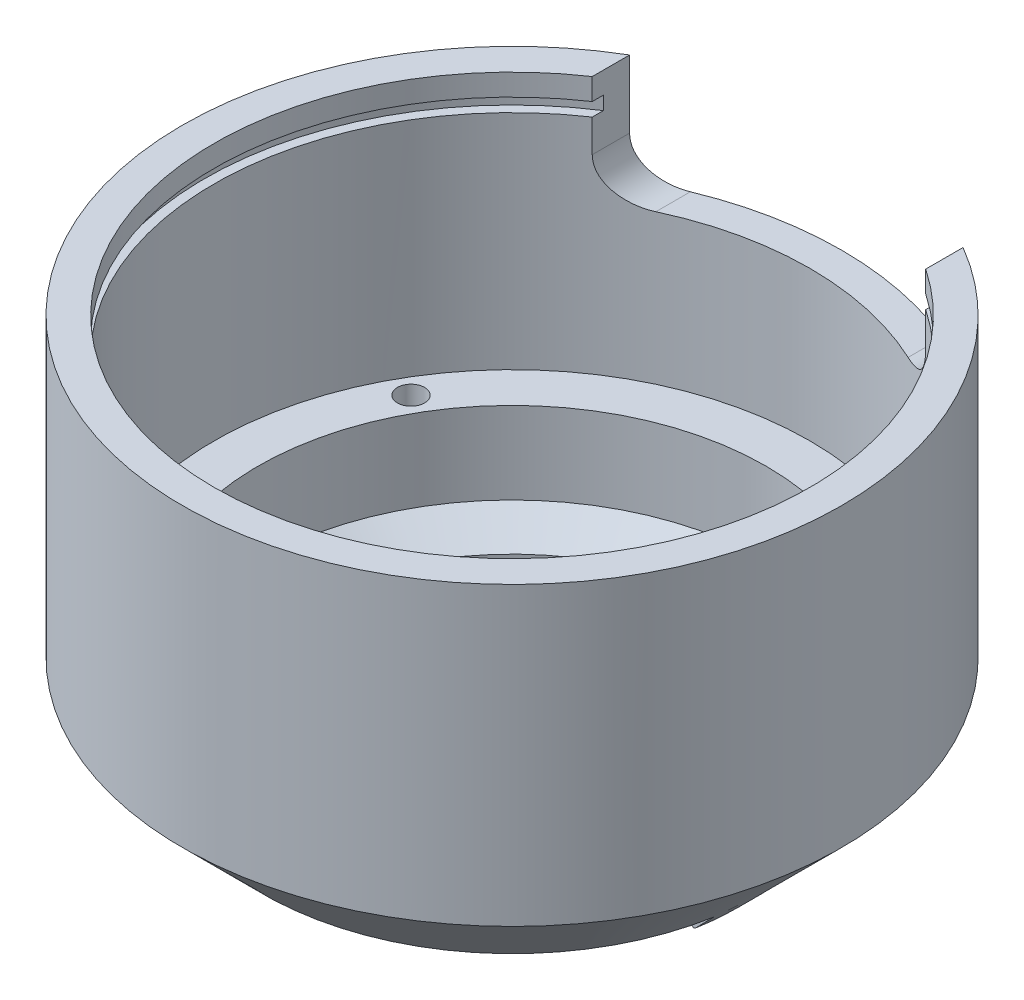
ISO-10303-21;
HEADER;
FILE_DESCRIPTION(('STEP AP214'),'2;1');
FILE_NAME('part.step','',(''),(''),'','','');
FILE_SCHEMA(('AUTOMOTIVE_DESIGN { 1 0 10303 214 1 1 1 1 }'));
ENDSEC;
DATA;
#1=APPLICATION_CONTEXT('core data for automotive mechanical design processes');
#2=APPLICATION_PROTOCOL_DEFINITION('international standard','automotive_design',2000,#1);
#3=PRODUCT_CONTEXT('',#1,'mechanical');
#4=PRODUCT('Part','Part','',(#3));
#5=PRODUCT_RELATED_PRODUCT_CATEGORY('part','',(#4));
#6=PRODUCT_DEFINITION_FORMATION('','',#4);
#7=PRODUCT_DEFINITION_CONTEXT('part definition',#1,'design');
#8=PRODUCT_DEFINITION('design','',#6,#7);
#9=PRODUCT_DEFINITION_SHAPE('','',#8);
#10=(LENGTH_UNIT() NAMED_UNIT(*) SI_UNIT(.MILLI.,.METRE.));
#11=(NAMED_UNIT(*) PLANE_ANGLE_UNIT() SI_UNIT($,.RADIAN.));
#12=(NAMED_UNIT(*) SI_UNIT($,.STERADIAN.) SOLID_ANGLE_UNIT());
#13=UNCERTAINTY_MEASURE_WITH_UNIT(LENGTH_MEASURE(1.E-05),#10,'distance_accuracy_value','');
#14=(GEOMETRIC_REPRESENTATION_CONTEXT(3) GLOBAL_UNCERTAINTY_ASSIGNED_CONTEXT((#13)) GLOBAL_UNIT_ASSIGNED_CONTEXT((#10,
#11,#12)) REPRESENTATION_CONTEXT('',''));
#15=CARTESIAN_POINT('',(0.,0.,0.));
#16=DIRECTION('',(0.,0.,1.));
#17=DIRECTION('',(1.,0.,0.));
#18=AXIS2_PLACEMENT_3D('',#15,#16,#17);
#19=CARTESIAN_POINT('',(0.,0.,0.));
#20=DIRECTION('',(0.,-1.,0.));
#21=DIRECTION('',(0.,0.,-1.));
#22=AXIS2_PLACEMENT_3D('',#19,#20,#21);
#23=CYLINDRICAL_SURFACE('',#22,12.954);
#24=CARTESIAN_POINT('',(0.,2.2098,0.));
#25=DIRECTION('',(0.,-1.,0.));
#26=DIRECTION('',(0.,0.,-1.));
#27=AXIS2_PLACEMENT_3D('',#24,#25,#26);
#28=CIRCLE('',#27,12.954);
#29=CARTESIAN_POINT('',(0.,2.2098,-12.954));
#30=VERTEX_POINT('',#29);
#31=EDGE_CURVE('E220',#30,#30,#28,.T.);
#32=ORIENTED_EDGE('',*,*,#31,.F.);
#33=EDGE_LOOP('',(#32));
#34=FACE_BOUND('',#33,.T.);
#35=DIRECTION('',(0.,-1.,0.));
#36=VECTOR('',#35,1.);
#37=CARTESIAN_POINT('',(-8.32667069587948,0.,9.9233397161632));
#38=LINE('',#37,#36);
#39=CARTESIAN_POINT('',(-8.32667069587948,1.397,9.9233397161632));
#40=VERTEX_POINT('',#39);
#41=CARTESIAN_POINT('',(-8.32667069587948,0.1778,9.9233397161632));
#42=VERTEX_POINT('',#41);
#43=EDGE_CURVE('E485',#40,#42,#38,.T.);
#44=ORIENTED_EDGE('',*,*,#43,.F.);
#45=CARTESIAN_POINT('',(0.,1.397,0.));
#46=DIRECTION('',(0.,1.,0.));
#47=DIRECTION('',(0.,0.,1.));
#48=AXIS2_PLACEMENT_3D('',#45,#46,#47);
#49=CIRCLE('',#48,12.954);
#50=CARTESIAN_POINT('',(-6.4769999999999,1.397,-11.2184930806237));
#51=VERTEX_POINT('',#50);
#52=EDGE_CURVE('E474',#40,#51,#49,.F.);
#53=ORIENTED_EDGE('',*,*,#52,.T.);
#54=DIRECTION('',(0.,-1.,0.));
#55=VECTOR('',#54,1.);
#56=CARTESIAN_POINT('',(-6.4769999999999,0.,-11.2184930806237));
#57=LINE('',#56,#55);
#58=CARTESIAN_POINT('',(-6.4769999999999,0.1778,-11.2184930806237));
#59=VERTEX_POINT('',#58);
#60=EDGE_CURVE('E481',#59,#51,#57,.F.);
#61=ORIENTED_EDGE('',*,*,#60,.F.);
#62=CARTESIAN_POINT('',(0.,0.1778,0.));
#63=DIRECTION('',(0.,-1.,0.));
#64=DIRECTION('',(0.,0.,-1.));
#65=AXIS2_PLACEMENT_3D('',#62,#63,#64);
#66=CIRCLE('',#65,12.954);
#67=CARTESIAN_POINT('',(-4.43052893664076,0.1778,-12.1727782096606));
#68=VERTEX_POINT('',#67);
#69=EDGE_CURVE('E215',#59,#68,#66,.T.);
#70=ORIENTED_EDGE('',*,*,#69,.T.);
#71=DIRECTION('',(0.,-1.,0.));
#72=VECTOR('',#71,1.);
#73=CARTESIAN_POINT('',(-4.43052893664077,0.,-12.1727782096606));
#74=LINE('',#73,#72);
#75=CARTESIAN_POINT('',(-4.43052893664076,1.397,-12.1727782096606));
#76=VERTEX_POINT('',#75);
#77=EDGE_CURVE('E423',#76,#68,#74,.T.);
#78=ORIENTED_EDGE('',*,*,#77,.F.);
#79=CARTESIAN_POINT('',(0.,1.397,0.));
#80=DIRECTION('',(0.,1.,0.));
#81=DIRECTION('',(0.,0.,1.));
#82=AXIS2_PLACEMENT_3D('',#79,#80,#81);
#83=CIRCLE('',#82,12.954);
#84=CARTESIAN_POINT('',(12.954,1.397,0.));
#85=VERTEX_POINT('',#84);
#86=EDGE_CURVE('E510',#76,#85,#83,.F.);
#87=ORIENTED_EDGE('',*,*,#86,.T.);
#88=DIRECTION('',(0.,-1.,0.));
#89=VECTOR('',#88,1.);
#90=CARTESIAN_POINT('',(12.954,0.,0.));
#91=LINE('',#90,#89);
#92=CARTESIAN_POINT('',(12.954,0.1778,0.));
#93=VERTEX_POINT('',#92);
#94=EDGE_CURVE('E515',#93,#85,#91,.F.);
#95=ORIENTED_EDGE('',*,*,#94,.F.);
#96=CARTESIAN_POINT('',(12.7571996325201,0.1778,2.24943849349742));
#97=VERTEX_POINT('',#96);
#98=EDGE_CURVE('E217',#93,#97,#66,.T.);
#99=ORIENTED_EDGE('',*,*,#98,.T.);
#100=DIRECTION('',(0.,-1.,0.));
#101=VECTOR('',#100,1.);
#102=CARTESIAN_POINT('',(12.7571996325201,0.,2.24943849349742));
#103=LINE('',#102,#101);
#104=CARTESIAN_POINT('',(12.7571996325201,1.397,2.24943849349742));
#105=VERTEX_POINT('',#104);
#106=EDGE_CURVE('E502',#105,#97,#103,.T.);
#107=ORIENTED_EDGE('',*,*,#106,.F.);
#108=CARTESIAN_POINT('',(0.,1.397,0.));
#109=DIRECTION('',(0.,1.,0.));
#110=DIRECTION('',(0.,0.,1.));
#111=AXIS2_PLACEMENT_3D('',#108,#109,#110);
#112=CIRCLE('',#111,12.954);
#113=CARTESIAN_POINT('',(-6.47700000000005,1.397,11.2184930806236));
#114=VERTEX_POINT('',#113);
#115=EDGE_CURVE('E493',#105,#114,#112,.F.);
#116=ORIENTED_EDGE('',*,*,#115,.T.);
#117=DIRECTION('',(0.,-1.,0.));
#118=VECTOR('',#117,1.);
#119=CARTESIAN_POINT('',(-6.47700000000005,0.,11.2184930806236));
#120=LINE('',#119,#118);
#121=CARTESIAN_POINT('',(-6.47700000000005,0.1778,11.2184930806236));
#122=VERTEX_POINT('',#121);
#123=EDGE_CURVE('E498',#122,#114,#120,.F.);
#124=ORIENTED_EDGE('',*,*,#123,.F.);
#125=EDGE_CURVE('E221',#122,#42,#66,.T.);
#126=ORIENTED_EDGE('',*,*,#125,.T.);
#127=EDGE_LOOP('',(#44,#53,#61,#70,#78,#87,#95,#99,#107,#116,#124,#126));
#128=FACE_BOUND('',#127,.T.);
#129=ADVANCED_FACE('F30',(#34,#128),#23,.F.);
#130=CARTESIAN_POINT('',(0.,0.1778,0.));
#131=DIRECTION('',(0.,-1.,0.));
#132=DIRECTION('',(0.,0.,-1.));
#133=AXIS2_PLACEMENT_3D('',#130,#131,#132);
#134=TOROIDAL_SURFACE('',#133,13.1318,0.1778);
#135=CARTESIAN_POINT('',(0.,0.0520764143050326,0.));
#136=DIRECTION('',(0.,-1.,0.));
#137=DIRECTION('',(0.,0.,-1.));
#138=AXIS2_PLACEMENT_3D('',#135,#136,#137);
#139=CIRCLE('',#138,13.257523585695);
#140=CARTESIAN_POINT('',(-6.62876179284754,0.0520764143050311,11.4813522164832));
#141=VERTEX_POINT('',#140);
#142=CARTESIAN_POINT('',(-8.52177189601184,0.0520764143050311,10.1558522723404));
#143=VERTEX_POINT('',#142);
#144=EDGE_CURVE('E216',#141,#143,#139,.T.);
#145=ORIENTED_EDGE('',*,*,#144,.T.);
#146=CARTESIAN_POINT('',(-8.44095833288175,0.1778,10.0595424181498));
#147=DIRECTION('',(-0.766044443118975,0.,-0.642787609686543));
#148=DIRECTION('',(-0.642787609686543,0.,0.766044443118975));
#149=AXIS2_PLACEMENT_3D('',#146,#147,#148);
#150=CIRCLE('',#149,0.1778);
#151=EDGE_CURVE('E483',#42,#143,#150,.T.);
#152=ORIENTED_EDGE('',*,*,#151,.F.);
#153=ORIENTED_EDGE('',*,*,#125,.F.);
#154=CARTESIAN_POINT('',(-6.56590000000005,0.1778,11.3724723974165));
#155=DIRECTION('',(0.866025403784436,0.,0.500000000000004));
#156=DIRECTION('',(0.500000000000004,0.,-0.866025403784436));
#157=AXIS2_PLACEMENT_3D('',#154,#155,#156);
#158=CIRCLE('',#157,0.1778);
#159=EDGE_CURVE('E496',#141,#122,#158,.T.);
#160=ORIENTED_EDGE('',*,*,#159,.F.);
#161=EDGE_LOOP('',(#145,#152,#153,#160));
#162=FACE_BOUND('',#161,.T.);
#163=ADVANCED_FACE('F372',(#162),#134,.T.);
#164=CARTESIAN_POINT('',(-6.5658999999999,0.1778,-11.3724723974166));
#165=DIRECTION('',(-0.866025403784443,0.,0.499999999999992));
#166=DIRECTION('',(0.499999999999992,0.,0.866025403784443));
#167=AXIS2_PLACEMENT_3D('',#164,#165,#166);
#168=CIRCLE('',#167,0.1778);
#169=CARTESIAN_POINT('',(-6.62876179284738,0.0520764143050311,-11.4813522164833));
#170=VERTEX_POINT('',#169);
#171=EDGE_CURVE('E479',#170,#59,#168,.T.);
#172=ORIENTED_EDGE('',*,*,#171,.F.);
#173=CARTESIAN_POINT('',(-4.53434011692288,0.0520764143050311,-12.4579970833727));
#174=VERTEX_POINT('',#173);
#175=EDGE_CURVE('E206',#170,#174,#139,.T.);
#176=ORIENTED_EDGE('',*,*,#175,.T.);
#177=CARTESIAN_POINT('',(-4.49134011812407,0.1778,-12.3398555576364));
#178=DIRECTION('',(0.939692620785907,0.,-0.342020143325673));
#179=DIRECTION('',(-0.342020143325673,0.,-0.939692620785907));
#180=AXIS2_PLACEMENT_3D('',#177,#178,#179);
#181=CIRCLE('',#180,0.1778);
#182=EDGE_CURVE('E428',#68,#174,#181,.T.);
#183=ORIENTED_EDGE('',*,*,#182,.F.);
#184=ORIENTED_EDGE('',*,*,#69,.F.);
#185=EDGE_LOOP('',(#172,#176,#183,#184));
#186=FACE_BOUND('',#185,.T.);
#187=ADVANCED_FACE('F378',(#186),#134,.T.);
#188=CARTESIAN_POINT('',(0.,6.12395282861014,0.));
#189=DIRECTION('',(0.,1.,0.));
#190=DIRECTION('',(0.,0.,1.));
#191=AXIS2_PLACEMENT_3D('',#188,#189,#190);
#192=CONICAL_SURFACE('',#191,19.3294,0.785398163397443);
#193=CARTESIAN_POINT('',(0.,6.12395282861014,0.));
#194=DIRECTION('',(0.,-1.,0.));
#195=DIRECTION('',(0.,0.,-1.));
#196=AXIS2_PLACEMENT_3D('',#193,#194,#195);
#197=CIRCLE('',#196,19.3294);
#198=CARTESIAN_POINT('',(0.,6.12395282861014,-19.3294));
#199=VERTEX_POINT('',#198);
#200=EDGE_CURVE('E202',#199,#199,#197,.T.);
#201=ORIENTED_EDGE('',*,*,#200,.T.);
#202=EDGE_LOOP('',(#201));
#203=FACE_BOUND('',#202,.T.);
#204=DIRECTION('',(-0.454519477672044,0.707106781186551,0.541675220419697));
#205=VECTOR('',#204,1.);
#206=CARTESIAN_POINT('',(0.,-13.2054471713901,0.));
#207=LINE('',#206,#205);
#208=CARTESIAN_POINT('',(-9.38627211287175,1.397,11.1861235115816));
#209=VERTEX_POINT('',#208);
#210=EDGE_CURVE('E254',#143,#209,#207,.T.);
#211=ORIENTED_EDGE('',*,*,#210,.F.);
#212=ORIENTED_EDGE('',*,*,#144,.F.);
#213=DIRECTION('',(0.353553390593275,-0.707106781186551,-0.61237243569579));
#214=VECTOR('',#213,1.);
#215=CARTESIAN_POINT('',(0.,-13.2054471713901,0.));
#216=LINE('',#215,#214);
#217=CARTESIAN_POINT('',(-7.30122358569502,1.397,12.6460902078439));
#218=VERTEX_POINT('',#217);
#219=EDGE_CURVE('E242',#218,#141,#216,.T.);
#220=ORIENTED_EDGE('',*,*,#219,.F.);
#221=CARTESIAN_POINT('',(0.,1.397,0.));
#222=DIRECTION('',(0.,1.,0.));
#223=DIRECTION('',(0.,0.,1.));
#224=AXIS2_PLACEMENT_3D('',#221,#222,#223);
#225=CIRCLE('',#224,14.6024471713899);
#226=CARTESIAN_POINT('',(14.380603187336,1.397,2.53568834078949));
#227=VERTEX_POINT('',#226);
#228=EDGE_CURVE('E239',#218,#227,#225,.T.);
#229=ORIENTED_EDGE('',*,*,#228,.T.);
#230=DIRECTION('',(0.696364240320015,0.707106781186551,0.122787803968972));
#231=VECTOR('',#230,1.);
#232=CARTESIAN_POINT('',(0.,-13.2054471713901,0.));
#233=LINE('',#232,#231);
#234=CARTESIAN_POINT('',(13.0561120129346,0.0520764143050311,2.30214481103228));
#235=VERTEX_POINT('',#234);
#236=EDGE_CURVE('E245',#235,#227,#233,.T.);
#237=ORIENTED_EDGE('',*,*,#236,.F.);
#238=CARTESIAN_POINT('',(13.257523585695,0.0520764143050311,0.));
#239=VERTEX_POINT('',#238);
#240=EDGE_CURVE('E212',#239,#235,#139,.T.);
#241=ORIENTED_EDGE('',*,*,#240,.F.);
#242=DIRECTION('',(-0.707106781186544,-0.707106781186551,0.));
#243=VECTOR('',#242,1.);
#244=CARTESIAN_POINT('',(0.,-13.2054471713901,0.));
#245=LINE('',#244,#243);
#246=CARTESIAN_POINT('',(14.6024471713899,1.397,0.));
#247=VERTEX_POINT('',#246);
#248=EDGE_CURVE('E233',#247,#239,#245,.T.);
#249=ORIENTED_EDGE('',*,*,#248,.F.);
#250=CARTESIAN_POINT('',(0.,1.397,0.));
#251=DIRECTION('',(0.,1.,0.));
#252=DIRECTION('',(0.,0.,1.));
#253=AXIS2_PLACEMENT_3D('',#250,#251,#252);
#254=CIRCLE('',#253,14.6024471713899);
#255=CARTESIAN_POINT('',(-4.99433107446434,1.397,-13.7218118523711));
#256=VERTEX_POINT('',#255);
#257=EDGE_CURVE('E230',#247,#256,#254,.T.);
#258=ORIENTED_EDGE('',*,*,#257,.T.);
#259=DIRECTION('',(-0.241844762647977,0.707106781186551,-0.66446302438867));
#260=VECTOR('',#259,1.);
#261=CARTESIAN_POINT('',(0.,-13.2054471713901,0.));
#262=LINE('',#261,#260);
#263=EDGE_CURVE('E236',#174,#256,#262,.T.);
#264=ORIENTED_EDGE('',*,*,#263,.F.);
#265=ORIENTED_EDGE('',*,*,#175,.F.);
#266=DIRECTION('',(0.353553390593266,-0.707106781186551,0.612372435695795));
#267=VECTOR('',#266,1.);
#268=CARTESIAN_POINT('',(0.,-13.2054471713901,0.));
#269=LINE('',#268,#267);
#270=CARTESIAN_POINT('',(-7.30122358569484,1.397,-12.646090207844));
#271=VERTEX_POINT('',#270);
#272=EDGE_CURVE('E251',#271,#170,#269,.T.);
#273=ORIENTED_EDGE('',*,*,#272,.F.);
#274=CARTESIAN_POINT('',(0.,1.397,0.));
#275=DIRECTION('',(0.,1.,0.));
#276=DIRECTION('',(0.,0.,1.));
#277=AXIS2_PLACEMENT_3D('',#274,#275,#276);
#278=CIRCLE('',#277,14.6024471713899);
#279=EDGE_CURVE('E248',#271,#209,#278,.T.);
#280=ORIENTED_EDGE('',*,*,#279,.T.);
#281=EDGE_LOOP('',(#211,#212,#220,#229,#237,#241,#249,#258,#264,#265,#273,#280));
#282=FACE_BOUND('',#281,.T.);
#283=ADVANCED_FACE('F404',(#203,#282),#192,.T.);
#284=ORIENTED_EDGE('',*,*,#240,.T.);
#285=CARTESIAN_POINT('',(12.9322984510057,0.1778,2.2803131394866));
#286=DIRECTION('',(-0.173648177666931,0.,0.984807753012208));
#287=DIRECTION('',(0.984807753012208,0.,0.173648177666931));
#288=AXIS2_PLACEMENT_3D('',#285,#286,#287);
#289=CIRCLE('',#288,0.1778);
#290=EDGE_CURVE('E500',#97,#235,#289,.T.);
#291=ORIENTED_EDGE('',*,*,#290,.F.);
#292=ORIENTED_EDGE('',*,*,#98,.F.);
#293=CARTESIAN_POINT('',(13.1318,0.1778,0.));
#294=DIRECTION('',(0.,0.,-1.));
#295=DIRECTION('',(-1.,0.,0.));
#296=AXIS2_PLACEMENT_3D('',#293,#294,#295);
#297=CIRCLE('',#296,0.1778);
#298=EDGE_CURVE('E513',#239,#93,#297,.T.);
#299=ORIENTED_EDGE('',*,*,#298,.F.);
#300=EDGE_LOOP('',(#284,#291,#292,#299));
#301=FACE_BOUND('',#300,.T.);
#302=ADVANCED_FACE('F381',(#301),#134,.T.);
#303=CARTESIAN_POINT('',(-14.90726,8.382,0.));
#304=DIRECTION('',(0.,-1.,0.));
#305=DIRECTION('',(0.,0.,-1.));
#306=AXIS2_PLACEMENT_3D('',#303,#304,#305);
#307=PLANE('',#306);
#308=CARTESIAN_POINT('',(14.0220164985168,8.382,-8.09561499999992));
#309=DIRECTION('',(0.,1.,0.));
#310=DIRECTION('',(0.,0.,1.));
#311=AXIS2_PLACEMENT_3D('',#308,#309,#310);
#312=CIRCLE('',#311,0.793749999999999);
#313=CARTESIAN_POINT('',(14.0220164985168,8.382,-7.30186499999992));
#314=VERTEX_POINT('',#313);
#315=EDGE_CURVE('E409',#314,#314,#312,.T.);
#316=ORIENTED_EDGE('',*,*,#315,.F.);
#317=EDGE_LOOP('',(#316));
#318=FACE_BOUND('',#317,.T.);
#319=CARTESIAN_POINT('',(-14.0220164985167,8.382,-8.09561500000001));
#320=DIRECTION('',(0.,1.,0.));
#321=DIRECTION('',(0.,0.,1.));
#322=AXIS2_PLACEMENT_3D('',#319,#320,#321);
#323=CIRCLE('',#322,0.793749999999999);
#324=CARTESIAN_POINT('',(-14.0220164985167,8.382,-7.30186500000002));
#325=VERTEX_POINT('',#324);
#326=EDGE_CURVE('E413',#325,#325,#323,.T.);
#327=ORIENTED_EDGE('',*,*,#326,.F.);
#328=EDGE_LOOP('',(#327));
#329=FACE_BOUND('',#328,.T.);
#330=CARTESIAN_POINT('',(0.,8.382,16.19123));
#331=DIRECTION('',(0.,1.,0.));
#332=DIRECTION('',(0.,0.,1.));
#333=AXIS2_PLACEMENT_3D('',#330,#331,#332);
#334=CIRCLE('',#333,0.793749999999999);
#335=CARTESIAN_POINT('',(0.,8.382,16.98498));
#336=VERTEX_POINT('',#335);
#337=EDGE_CURVE('E417',#336,#336,#334,.T.);
#338=ORIENTED_EDGE('',*,*,#337,.F.);
#339=EDGE_LOOP('',(#338));
#340=FACE_BOUND('',#339,.T.);
#341=CARTESIAN_POINT('',(0.,8.382,0.));
#342=DIRECTION('',(0.,-1.,0.));
#343=DIRECTION('',(0.,0.,-1.));
#344=AXIS2_PLACEMENT_3D('',#341,#342,#343);
#345=CIRCLE('',#344,17.4752);
#346=CARTESIAN_POINT('',(0.,8.382,-17.4752));
#347=VERTEX_POINT('',#346);
#348=EDGE_CURVE('E420',#347,#347,#345,.T.);
#349=ORIENTED_EDGE('',*,*,#348,.F.);
#350=EDGE_LOOP('',(#349));
#351=FACE_BOUND('',#350,.T.);
#352=CARTESIAN_POINT('',(0.,8.382,0.));
#353=DIRECTION('',(0.,-1.,0.));
#354=DIRECTION('',(0.,0.,-1.));
#355=AXIS2_PLACEMENT_3D('',#352,#353,#354);
#356=CIRCLE('',#355,14.90726);
#357=CARTESIAN_POINT('',(0.,8.382,-14.90726));
#358=VERTEX_POINT('',#357);
#359=EDGE_CURVE('E227',#358,#358,#356,.T.);
#360=ORIENTED_EDGE('',*,*,#359,.T.);
#361=EDGE_LOOP('',(#360));
#362=FACE_BOUND('',#361,.T.);
#363=ADVANCED_FACE('F32',(#318,#329,#340,#351,#362),#307,.F.);
#364=CARTESIAN_POINT('',(0.,0.,0.));
#365=DIRECTION('',(0.,-1.,0.));
#366=DIRECTION('',(0.,0.,-1.));
#367=AXIS2_PLACEMENT_3D('',#364,#365,#366);
#368=CYLINDRICAL_SURFACE('',#367,14.90726);
#369=ORIENTED_EDGE('',*,*,#359,.F.);
#370=EDGE_LOOP('',(#369));
#371=FACE_BOUND('',#370,.T.);
#372=CARTESIAN_POINT('',(0.,3.57748737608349,0.));
#373=DIRECTION('',(0.,-1.,0.));
#374=DIRECTION('',(0.,0.,-1.));
#375=AXIS2_PLACEMENT_3D('',#372,#373,#374);
#376=CIRCLE('',#375,14.90726);
#377=CARTESIAN_POINT('',(0.,3.57748737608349,-14.90726));
#378=VERTEX_POINT('',#377);
#379=EDGE_CURVE('E224',#378,#378,#376,.T.);
#380=ORIENTED_EDGE('',*,*,#379,.T.);
#381=EDGE_LOOP('',(#380));
#382=FACE_BOUND('',#381,.T.);
#383=ADVANCED_FACE('F388',(#371,#382),#368,.F.);
#384=CARTESIAN_POINT('',(0.,2.2098,0.));
#385=DIRECTION('',(0.,1.,0.));
#386=DIRECTION('',(0.,0.,1.));
#387=AXIS2_PLACEMENT_3D('',#384,#385,#386);
#388=CONICAL_SURFACE('',#387,12.954,0.959931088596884);
#389=ORIENTED_EDGE('',*,*,#379,.F.);
#390=EDGE_LOOP('',(#389));
#391=FACE_BOUND('',#390,.T.);
#392=ORIENTED_EDGE('',*,*,#31,.T.);
#393=EDGE_LOOP('',(#392));
#394=FACE_BOUND('',#393,.T.);
#395=ADVANCED_FACE('F386',(#391,#394),#388,.F.);
#396=CARTESIAN_POINT('',(0.,0.,0.));
#397=DIRECTION('',(0.,-1.,0.));
#398=DIRECTION('',(0.,0.,-1.));
#399=AXIS2_PLACEMENT_3D('',#396,#397,#398);
#400=CYLINDRICAL_SURFACE('',#399,19.3294);
#401=ORIENTED_EDGE('',*,*,#200,.F.);
#402=EDGE_LOOP('',(#401));
#403=FACE_BOUND('',#402,.T.);
#404=DIRECTION('',(0.,-1.,0.));
#405=VECTOR('',#404,1.);
#406=CARTESIAN_POINT('',(-9.77899999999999,0.,-16.6732379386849));
#407=LINE('',#406,#405);
#408=CARTESIAN_POINT('',(-9.779,23.495,-16.6732379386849));
#409=VERTEX_POINT('',#408);
#410=CARTESIAN_POINT('',(-9.77899999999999,19.52625,-16.6732379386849));
#411=VERTEX_POINT('',#410);
#412=EDGE_CURVE('E452',#409,#411,#407,.T.);
#413=ORIENTED_EDGE('',*,*,#412,.T.);
#414=CARTESIAN_POINT('',(-9.779,19.52625,-16.6732379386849));
#415=CARTESIAN_POINT('',(-9.77901067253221,19.4653539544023,-16.6732289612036));
#416=CARTESIAN_POINT('',(-9.77666434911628,19.4044649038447,-16.6746077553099));
#417=CARTESIAN_POINT('',(-9.7673400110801,19.2831890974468,-16.6800727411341));
#418=CARTESIAN_POINT('',(-9.76036389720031,19.222802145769,-16.6841578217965));
#419=CARTESIAN_POINT('',(-9.74190651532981,19.1032554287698,-16.694941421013));
#420=CARTESIAN_POINT('',(-9.73044701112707,19.044091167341,-16.7016273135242));
#421=CARTESIAN_POINT('',(-9.70318131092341,18.9271262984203,-16.7174826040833));
#422=CARTESIAN_POINT('',(-9.68737484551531,18.8693257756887,-16.726652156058));
#423=CARTESIAN_POINT('',(-9.63374745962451,18.6987039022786,-16.7576350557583));
#424=CARTESIAN_POINT('',(-9.5896774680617,18.5884021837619,-16.7829470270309));
#425=CARTESIAN_POINT('',(-9.48672995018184,18.3771771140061,-16.8413521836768));
#426=CARTESIAN_POINT('',(-9.42783692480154,18.2762637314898,-16.8744535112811));
#427=CARTESIAN_POINT('',(-9.29317943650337,18.0796128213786,-16.9490055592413));
#428=CARTESIAN_POINT('',(-9.21659362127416,17.984587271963,-16.9908474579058));
#429=CARTESIAN_POINT('',(-9.05128399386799,17.8084649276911,-17.0794836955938));
#430=CARTESIAN_POINT('',(-8.96255569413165,17.7273733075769,-17.1262798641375));
#431=CARTESIAN_POINT('',(-8.76306456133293,17.5706584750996,-17.2292928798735));
#432=CARTESIAN_POINT('',(-8.6509349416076,17.4970602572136,-17.2859492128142));
#433=CARTESIAN_POINT('',(-8.41674530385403,17.3699166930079,-17.4011825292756));
#434=CARTESIAN_POINT('',(-8.29468200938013,17.3163779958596,-17.4597601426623));
#435=CARTESIAN_POINT('',(-8.04552246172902,17.2310914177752,-17.5759436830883));
#436=CARTESIAN_POINT('',(-7.91855226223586,17.1989773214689,-17.6335486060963));
#437=CARTESIAN_POINT('',(-7.72506584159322,17.166694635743,-17.7187488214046));
#438=CARTESIAN_POINT('',(-7.66005526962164,17.1585817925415,-17.7469518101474));
#439=CARTESIAN_POINT('',(-7.52934056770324,17.1477352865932,-17.8028030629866));
#440=CARTESIAN_POINT('',(-7.46363634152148,17.145002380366,-17.8304512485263));
#441=CARTESIAN_POINT('',(-7.39775,17.145,-17.8577433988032));
#442=B_SPLINE_CURVE_WITH_KNOTS('',3,(#414,#415,#416,#417,#418,#419,#420,#421,#422,#423,#424,
#425,#426,#427,#428,#429,#430,#431,#432,#433,#434,#435,#436,#437,#438,#439,#440,#441),
.UNSPECIFIED.,.F.,.F.,(4,2,2,2,2,2,2,2,2,2,2,2,2,4),(0.,0.182615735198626,0.365156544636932,
0.546822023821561,0.728498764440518,1.09106911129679,1.45402015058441,1.8395390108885,
2.2252007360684,2.66017469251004,3.09529270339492,3.52276834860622,3.73656988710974,
3.95040148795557),.UNSPECIFIED.);
#443=CARTESIAN_POINT('',(-7.39775,17.145,-17.8577433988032));
#444=VERTEX_POINT('',#443);
#445=EDGE_CURVE('E281',#411,#444,#442,.T.);
#446=ORIENTED_EDGE('',*,*,#445,.T.);
#447=CARTESIAN_POINT('',(0.,17.145,0.));
#448=DIRECTION('',(0.,-1.,0.));
#449=DIRECTION('',(0.,0.,-1.));
#450=AXIS2_PLACEMENT_3D('',#447,#448,#449);
#451=CIRCLE('',#450,19.3294);
#452=CARTESIAN_POINT('',(7.39775,17.145,-17.8577433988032));
#453=VERTEX_POINT('',#452);
#454=EDGE_CURVE('E585',#444,#453,#451,.T.);
#455=ORIENTED_EDGE('',*,*,#454,.T.);
#456=CARTESIAN_POINT('',(7.39775,17.145,-17.8577433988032));
#457=CARTESIAN_POINT('',(7.47107958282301,17.1450036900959,-17.827368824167));
#458=CARTESIAN_POINT('',(7.54417835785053,17.1483883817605,-17.7965541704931));
#459=CARTESIAN_POINT('',(7.6894643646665,17.1618086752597,-17.7342626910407));
#460=CARTESIAN_POINT('',(7.76165174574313,17.1718431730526,-17.7027859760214));
#461=CARTESIAN_POINT('',(7.97612225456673,17.2117404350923,-17.6077125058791));
#462=CARTESIAN_POINT('',(8.11640335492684,17.2513972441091,-17.5434352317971));
#463=CARTESIAN_POINT('',(8.38755804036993,17.3555919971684,-17.4154273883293));
#464=CARTESIAN_POINT('',(8.51843238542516,17.4201279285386,-17.3516967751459));
#465=CARTESIAN_POINT('',(8.76732059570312,17.5728097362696,-17.2272789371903));
#466=CARTESIAN_POINT('',(8.88533383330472,17.6609567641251,-17.1665918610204));
#467=CARTESIAN_POINT('',(9.10347177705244,17.8582433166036,-17.0519073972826));
#468=CARTESIAN_POINT('',(9.20377996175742,17.9671397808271,-16.9978434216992));
#469=CARTESIAN_POINT('',(9.38400278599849,18.2043885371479,-16.8990170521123));
#470=CARTESIAN_POINT('',(9.46392766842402,18.3327310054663,-16.8542499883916));
#471=CARTESIAN_POINT('',(9.59218922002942,18.5916710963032,-16.7815534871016));
#472=CARTESIAN_POINT('',(9.64290927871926,18.7207165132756,-16.7523759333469));
#473=CARTESIAN_POINT('',(9.70176433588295,18.9206791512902,-16.7183123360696));
#474=CARTESIAN_POINT('',(9.71850655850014,18.9883531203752,-16.7085781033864));
#475=CARTESIAN_POINT('',(9.7460344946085,19.1252848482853,-16.6925365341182));
#476=CARTESIAN_POINT('',(9.75682442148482,19.1945414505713,-16.6862267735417));
#477=CARTESIAN_POINT('',(9.76935338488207,19.3076986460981,-16.6788929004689));
#478=CARTESIAN_POINT('',(9.772970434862,19.3513328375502,-16.6767732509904));
#479=CARTESIAN_POINT('',(9.77779301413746,19.4387252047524,-16.6739458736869));
#480=CARTESIAN_POINT('',(9.77900153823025,19.4824831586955,-16.6732363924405));
#481=CARTESIAN_POINT('',(9.779,19.52625,-16.6732379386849));
#482=B_SPLINE_CURVE_WITH_KNOTS('',3,(#456,#457,#458,#459,#460,#461,#462,#463,#464,#465,#466,
#467,#468,#469,#470,#471,#472,#473,#474,#475,#476,#477,#478,#479,#480,#481),.UNSPECIFIED.,.F.,
.F.,(4,2,2,2,2,2,2,2,2,2,2,2,4),(0.,0.237956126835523,0.475872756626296,0.9514186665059,
1.42692611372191,1.9024567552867,2.37272593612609,2.84275833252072,3.26506432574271,
3.47594374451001,3.68667369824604,3.81809797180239,3.94935872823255),.UNSPECIFIED.);
#483=CARTESIAN_POINT('',(9.77900000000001,19.52625,-16.6732379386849));
#484=VERTEX_POINT('',#483);
#485=EDGE_CURVE('E11',#453,#484,#482,.T.);
#486=ORIENTED_EDGE('',*,*,#485,.T.);
#487=DIRECTION('',(0.,-1.,0.));
#488=VECTOR('',#487,1.);
#489=CARTESIAN_POINT('',(9.77900000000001,0.,-16.6732379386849));
#490=LINE('',#489,#488);
#491=CARTESIAN_POINT('',(9.779,23.495,-16.6732379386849));
#492=VERTEX_POINT('',#491);
#493=EDGE_CURVE('E181',#484,#492,#490,.F.);
#494=ORIENTED_EDGE('',*,*,#493,.T.);
#495=CARTESIAN_POINT('',(0.,23.495,0.));
#496=DIRECTION('',(0.,-1.,0.));
#497=DIRECTION('',(0.,0.,-1.));
#498=AXIS2_PLACEMENT_3D('',#495,#496,#497);
#499=CIRCLE('',#498,19.3294);
#500=EDGE_CURVE('E186',#492,#409,#499,.T.);
#501=ORIENTED_EDGE('',*,*,#500,.T.);
#502=EDGE_LOOP('',(#413,#446,#455,#486,#494,#501));
#503=FACE_BOUND('',#502,.T.);
#504=ADVANCED_FACE('F184',(#403,#503),#400,.T.);
#505=CARTESIAN_POINT('',(-17.4752,23.495,0.));
#506=DIRECTION('',(0.,-1.,0.));
#507=DIRECTION('',(0.,0.,-1.));
#508=AXIS2_PLACEMENT_3D('',#505,#506,#507);
#509=PLANE('',#508);
#510=CARTESIAN_POINT('',(0.,23.495,0.));
#511=DIRECTION('',(0.,-1.,0.));
#512=DIRECTION('',(0.,0.,-1.));
#513=AXIS2_PLACEMENT_3D('',#510,#511,#512);
#514=CIRCLE('',#513,17.4752);
#515=CARTESIAN_POINT('',(9.779,23.495,-14.4828786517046));
#516=VERTEX_POINT('',#515);
#517=CARTESIAN_POINT('',(-9.779,23.495,-14.4828786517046));
#518=VERTEX_POINT('',#517);
#519=EDGE_CURVE('E203',#516,#518,#514,.T.);
#520=ORIENTED_EDGE('',*,*,#519,.T.);
#521=DIRECTION('',(0.,0.,1.));
#522=VECTOR('',#521,1.);
#523=CARTESIAN_POINT('',(-9.779,23.495,-19.3294));
#524=LINE('',#523,#522);
#525=EDGE_CURVE('E198',#409,#518,#524,.T.);
#526=ORIENTED_EDGE('',*,*,#525,.F.);
#527=ORIENTED_EDGE('',*,*,#500,.F.);
#528=DIRECTION('',(0.,0.,1.));
#529=VECTOR('',#528,1.);
#530=CARTESIAN_POINT('',(9.779,23.495,-19.3294));
#531=LINE('',#530,#529);
#532=EDGE_CURVE('E192',#492,#516,#531,.T.);
#533=ORIENTED_EDGE('',*,*,#532,.T.);
#534=EDGE_LOOP('',(#520,#526,#527,#533));
#535=FACE_BOUND('',#534,.T.);
#536=ADVANCED_FACE('F201',(#535),#509,.F.);
#537=CARTESIAN_POINT('',(0.,0.,0.));
#538=DIRECTION('',(0.,-1.,0.));
#539=DIRECTION('',(0.,0.,-1.));
#540=AXIS2_PLACEMENT_3D('',#537,#538,#539);
#541=CYLINDRICAL_SURFACE('',#540,17.4752);
#542=CARTESIAN_POINT('',(0.,22.225,0.));
#543=DIRECTION('',(0.,-1.,0.));
#544=DIRECTION('',(0.,0.,-1.));
#545=AXIS2_PLACEMENT_3D('',#542,#543,#544);
#546=CIRCLE('',#545,17.4752);
#547=CARTESIAN_POINT('',(9.779,22.225,-14.4828786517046));
#548=VERTEX_POINT('',#547);
#549=CARTESIAN_POINT('',(-9.779,22.225,-14.4828786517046));
#550=VERTEX_POINT('',#549);
#551=EDGE_CURVE('E208',#548,#550,#546,.T.);
#552=ORIENTED_EDGE('',*,*,#551,.T.);
#553=DIRECTION('',(0.,-1.,0.));
#554=VECTOR('',#553,1.);
#555=CARTESIAN_POINT('',(-9.77899999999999,0.,-14.4828786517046));
#556=LINE('',#555,#554);
#557=EDGE_CURVE('E441',#550,#518,#556,.F.);
#558=ORIENTED_EDGE('',*,*,#557,.T.);
#559=ORIENTED_EDGE('',*,*,#519,.F.);
#560=DIRECTION('',(0.,-1.,0.));
#561=VECTOR('',#560,1.);
#562=CARTESIAN_POINT('',(9.77900000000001,0.,-14.4828786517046));
#563=LINE('',#562,#561);
#564=EDGE_CURVE('E189',#516,#548,#563,.T.);
#565=ORIENTED_EDGE('',*,*,#564,.T.);
#566=EDGE_LOOP('',(#552,#558,#559,#565));
#567=FACE_BOUND('',#566,.T.);
#568=ADVANCED_FACE('F440',(#567),#541,.F.);
#569=CARTESIAN_POINT('',(-18.0213,22.225,0.));
#570=DIRECTION('',(0.,1.,0.));
#571=DIRECTION('',(0.,0.,1.));
#572=AXIS2_PLACEMENT_3D('',#569,#570,#571);
#573=PLANE('',#572);
#574=CARTESIAN_POINT('',(0.,22.225,0.));
#575=DIRECTION('',(0.,-1.,0.));
#576=DIRECTION('',(0.,0.,-1.));
#577=AXIS2_PLACEMENT_3D('',#574,#575,#576);
#578=CIRCLE('',#577,18.0213);
#579=CARTESIAN_POINT('',(9.77900000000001,22.225,-15.1373185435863));
#580=VERTEX_POINT('',#579);
#581=CARTESIAN_POINT('',(-9.77899999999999,22.225,-15.1373185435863));
#582=VERTEX_POINT('',#581);
#583=EDGE_CURVE('E434',#580,#582,#578,.T.);
#584=ORIENTED_EDGE('',*,*,#583,.T.);
#585=DIRECTION('',(0.,0.,1.));
#586=VECTOR('',#585,1.);
#587=CARTESIAN_POINT('',(-9.779,22.225,0.));
#588=LINE('',#587,#586);
#589=EDGE_CURVE('E448',#582,#550,#588,.T.);
#590=ORIENTED_EDGE('',*,*,#589,.T.);
#591=ORIENTED_EDGE('',*,*,#551,.F.);
#592=DIRECTION('',(0.,0.,-1.));
#593=VECTOR('',#592,1.);
#594=CARTESIAN_POINT('',(9.779,22.225,0.));
#595=LINE('',#594,#593);
#596=EDGE_CURVE('E446',#548,#580,#595,.T.);
#597=ORIENTED_EDGE('',*,*,#596,.T.);
#598=EDGE_LOOP('',(#584,#590,#591,#597));
#599=FACE_BOUND('',#598,.T.);
#600=ADVANCED_FACE('F445',(#599),#573,.F.);
#601=CARTESIAN_POINT('',(0.,0.,0.));
#602=DIRECTION('',(0.,-1.,0.));
#603=DIRECTION('',(0.,0.,-1.));
#604=AXIS2_PLACEMENT_3D('',#601,#602,#603);
#605=CYLINDRICAL_SURFACE('',#604,18.0213);
#606=CARTESIAN_POINT('',(0.,21.4376,0.));
#607=DIRECTION('',(0.,-1.,0.));
#608=DIRECTION('',(0.,0.,-1.));
#609=AXIS2_PLACEMENT_3D('',#606,#607,#608);
#610=CIRCLE('',#609,18.0213);
#611=CARTESIAN_POINT('',(9.779,21.4376,-15.1373185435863));
#612=VERTEX_POINT('',#611);
#613=CARTESIAN_POINT('',(-9.779,21.4376,-15.1373185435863));
#614=VERTEX_POINT('',#613);
#615=EDGE_CURVE('E426',#612,#614,#610,.T.);
#616=ORIENTED_EDGE('',*,*,#615,.T.);
#617=DIRECTION('',(0.,-1.,0.));
#618=VECTOR('',#617,1.);
#619=CARTESIAN_POINT('',(-9.77899999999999,0.,-15.1373185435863));
#620=LINE('',#619,#618);
#621=EDGE_CURVE('E450',#614,#582,#620,.F.);
#622=ORIENTED_EDGE('',*,*,#621,.T.);
#623=ORIENTED_EDGE('',*,*,#583,.F.);
#624=DIRECTION('',(0.,-1.,0.));
#625=VECTOR('',#624,1.);
#626=CARTESIAN_POINT('',(9.77900000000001,0.,-15.1373185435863));
#627=LINE('',#626,#625);
#628=EDGE_CURVE('E581',#580,#612,#627,.T.);
#629=ORIENTED_EDGE('',*,*,#628,.T.);
#630=EDGE_LOOP('',(#616,#622,#623,#629));
#631=FACE_BOUND('',#630,.T.);
#632=ADVANCED_FACE('F563',(#631),#605,.F.);
#633=CARTESIAN_POINT('',(-17.4752,21.4376,0.));
#634=DIRECTION('',(0.,-1.,0.));
#635=DIRECTION('',(0.,0.,-1.));
#636=AXIS2_PLACEMENT_3D('',#633,#634,#635);
#637=PLANE('',#636);
#638=CARTESIAN_POINT('',(0.,21.4376,0.));
#639=DIRECTION('',(0.,-1.,0.));
#640=DIRECTION('',(0.,0.,-1.));
#641=AXIS2_PLACEMENT_3D('',#638,#639,#640);
#642=CIRCLE('',#641,17.4752);
#643=CARTESIAN_POINT('',(9.77900000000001,21.4376,-14.4828786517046));
#644=VERTEX_POINT('',#643);
#645=CARTESIAN_POINT('',(-9.77899999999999,21.4376,-14.4828786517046));
#646=VERTEX_POINT('',#645);
#647=EDGE_CURVE('E422',#644,#646,#642,.T.);
#648=ORIENTED_EDGE('',*,*,#647,.T.);
#649=DIRECTION('',(0.,0.,-1.));
#650=VECTOR('',#649,1.);
#651=CARTESIAN_POINT('',(-9.779,21.4376,0.));
#652=LINE('',#651,#650);
#653=EDGE_CURVE('E188',#646,#614,#652,.T.);
#654=ORIENTED_EDGE('',*,*,#653,.T.);
#655=ORIENTED_EDGE('',*,*,#615,.F.);
#656=DIRECTION('',(0.,0.,1.));
#657=VECTOR('',#656,1.);
#658=CARTESIAN_POINT('',(9.779,21.4376,0.));
#659=LINE('',#658,#657);
#660=EDGE_CURVE('E575',#612,#644,#659,.T.);
#661=ORIENTED_EDGE('',*,*,#660,.T.);
#662=EDGE_LOOP('',(#648,#654,#655,#661));
#663=FACE_BOUND('',#662,.T.);
#664=ADVANCED_FACE('F368',(#663),#637,.F.);
#665=CARTESIAN_POINT('',(0.,0.,0.));
#666=DIRECTION('',(0.,-1.,0.));
#667=DIRECTION('',(0.,0.,-1.));
#668=AXIS2_PLACEMENT_3D('',#665,#666,#667);
#669=CYLINDRICAL_SURFACE('',#668,17.4752);
#670=DIRECTION('',(0.,-1.,0.));
#671=VECTOR('',#670,1.);
#672=CARTESIAN_POINT('',(9.77900000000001,0.,-14.4828786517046));
#673=LINE('',#672,#671);
#674=CARTESIAN_POINT('',(9.77900000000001,19.52625,-14.4828786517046));
#675=VERTEX_POINT('',#674);
#676=EDGE_CURVE('E260',#644,#675,#673,.T.);
#677=ORIENTED_EDGE('',*,*,#676,.T.);
#678=CARTESIAN_POINT('',(9.779,19.52625,-14.4828786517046));
#679=CARTESIAN_POINT('',(9.77901152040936,19.4667991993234,-14.4828678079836));
#680=CARTESIAN_POINT('',(9.77677396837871,19.4073565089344,-14.4843816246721));
#681=CARTESIAN_POINT('',(9.76788965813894,19.2889818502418,-14.4903760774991));
#682=CARTESIAN_POINT('',(9.76124516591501,19.2300496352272,-14.4948551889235));
#683=CARTESIAN_POINT('',(9.74368622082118,19.1134635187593,-14.5066639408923));
#684=CARTESIAN_POINT('',(9.73279646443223,19.0558042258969,-14.5139770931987));
#685=CARTESIAN_POINT('',(9.70691341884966,18.9418399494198,-14.5313003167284));
#686=CARTESIAN_POINT('',(9.69191978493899,18.8855350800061,-14.5413106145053));
#687=CARTESIAN_POINT('',(9.64112463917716,18.7194161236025,-14.5750812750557));
#688=CARTESIAN_POINT('',(9.59946093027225,18.6120878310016,-14.6026141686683));
#689=CARTESIAN_POINT('',(9.50237168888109,18.4064736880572,-14.6659773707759));
#690=CARTESIAN_POINT('',(9.44692785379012,18.3082001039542,-14.7018187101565));
#691=CARTESIAN_POINT('',(9.31961276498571,18.1151723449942,-14.7828797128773));
#692=CARTESIAN_POINT('',(9.24681915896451,18.0212398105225,-14.828602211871));
#693=CARTESIAN_POINT('',(9.08981758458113,17.8466476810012,-14.9253590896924));
#694=CARTESIAN_POINT('',(9.00560559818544,17.7659927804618,-14.9763953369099));
#695=CARTESIAN_POINT('',(8.8133048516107,17.6067327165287,-15.0904827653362));
#696=CARTESIAN_POINT('',(8.70355644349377,17.5305623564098,-15.1541432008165));
#697=CARTESIAN_POINT('',(8.47395148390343,17.3979293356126,-15.2837227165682));
#698=CARTESIAN_POINT('',(8.35408941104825,17.3414775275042,-15.3496430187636));
#699=CARTESIAN_POINT('',(8.09810731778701,17.2459534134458,-15.486306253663));
#700=CARTESIAN_POINT('',(7.961436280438,17.2083581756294,-15.5570665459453));
#701=CARTESIAN_POINT('',(7.75247814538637,17.1705027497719,-15.6616669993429));
#702=CARTESIAN_POINT('',(7.68214433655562,17.1609737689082,-15.6962876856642));
#703=CARTESIAN_POINT('',(7.54054669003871,17.148224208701,-15.7648015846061));
#704=CARTESIAN_POINT('',(7.46928273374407,17.1450044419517,-15.7986947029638));
#705=CARTESIAN_POINT('',(7.39775,17.145,-15.8321164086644));
#706=B_SPLINE_CURVE_WITH_KNOTS('',3,(#678,#679,#680,#681,#682,#683,#684,#685,#686,#687,#688,
#689,#690,#691,#692,#693,#694,#695,#696,#697,#698,#699,#700,#701,#702,#703,#704,#705),
.UNSPECIFIED.,.F.,.F.,(4,2,2,2,2,2,2,2,2,2,2,2,2,4),(0.,0.178277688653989,0.356463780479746,
0.533628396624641,0.710807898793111,1.06423328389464,1.41813061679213,1.79866499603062,
2.1793336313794,2.62148173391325,3.06387280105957,3.53694893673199,3.77363434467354,
4.01035023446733),.UNSPECIFIED.);
#707=CARTESIAN_POINT('',(7.39775,17.145,-15.8321164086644));
#708=VERTEX_POINT('',#707);
#709=EDGE_CURVE('E43',#675,#708,#706,.T.);
#710=ORIENTED_EDGE('',*,*,#709,.T.);
#711=CARTESIAN_POINT('',(0.,17.145,0.));
#712=DIRECTION('',(0.,-1.,0.));
#713=DIRECTION('',(0.,0.,-1.));
#714=AXIS2_PLACEMENT_3D('',#711,#712,#713);
#715=CIRCLE('',#714,17.4752);
#716=CARTESIAN_POINT('',(-7.39775,17.145,-15.8321164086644));
#717=VERTEX_POINT('',#716);
#718=EDGE_CURVE('E257',#708,#717,#715,.F.);
#719=ORIENTED_EDGE('',*,*,#718,.T.);
#720=CARTESIAN_POINT('',(-7.39775,17.145,-15.8321164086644));
#721=CARTESIAN_POINT('',(-7.47280164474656,17.1450045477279,-15.7970512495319));
#722=CARTESIAN_POINT('',(-7.54755672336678,17.1485489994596,-15.7614664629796));
#723=CARTESIAN_POINT('',(-7.69601328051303,17.1625757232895,-15.6895118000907));
#724=CARTESIAN_POINT('',(-7.76971497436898,17.1730565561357,-15.653142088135));
#725=CARTESIAN_POINT('',(-7.98851433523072,17.2146774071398,-15.5432555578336));
#726=CARTESIAN_POINT('',(-8.13139148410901,17.2559961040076,-15.4689214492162));
#727=CARTESIAN_POINT('',(-8.40713877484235,17.3644330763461,-15.3208086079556));
#728=CARTESIAN_POINT('',(-8.54001257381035,17.431541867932,-15.2470296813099));
#729=CARTESIAN_POINT('',(-8.7923971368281,17.5903880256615,-15.1028967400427));
#730=CARTESIAN_POINT('',(-8.9119011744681,17.6821377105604,-15.0325444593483));
#731=CARTESIAN_POINT('',(-9.13225182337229,17.8878826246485,-14.8996957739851));
#732=CARTESIAN_POINT('',(-9.23330706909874,18.001594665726,-14.8371144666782));
#733=CARTESIAN_POINT('',(-9.36859864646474,18.187595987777,-14.7517744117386));
#734=CARTESIAN_POINT('',(-9.41097285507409,18.2521522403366,-14.7247548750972));
#735=CARTESIAN_POINT('',(-9.48972340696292,18.386063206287,-14.6741250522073));
#736=CARTESIAN_POINT('',(-9.52610242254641,18.455415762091,-14.6505132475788));
#737=CARTESIAN_POINT('',(-9.6068196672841,18.6300113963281,-14.597769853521));
#738=CARTESIAN_POINT('',(-9.64759648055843,18.737598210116,-14.5707938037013));
#739=CARTESIAN_POINT('',(-9.71339951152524,18.9593012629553,-14.5270118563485));
#740=CARTESIAN_POINT('',(-9.73845987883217,19.0734027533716,-14.5101839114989));
#741=CARTESIAN_POINT('',(-9.76298246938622,19.2448185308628,-14.4936837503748));
#742=CARTESIAN_POINT('',(-9.7689797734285,19.3008605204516,-14.48964055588));
#743=CARTESIAN_POINT('',(-9.77698978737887,19.4133419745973,-14.4842361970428));
#744=CARTESIAN_POINT('',(-9.77900351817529,19.4697813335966,-14.482874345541));
#745=CARTESIAN_POINT('',(-9.779,19.52625,-14.4828786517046));
#746=B_SPLINE_CURVE_WITH_KNOTS('',3,(#720,#721,#722,#723,#724,#725,#726,#727,#728,#729,#730,
#731,#732,#733,#734,#735,#736,#737,#738,#739,#740,#741,#742,#743,#744,#745),.UNSPECIFIED.,.F.,
.F.,(4,2,2,2,2,2,2,2,2,2,2,2,4),(0.,0.248348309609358,0.496645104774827,0.992960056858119,
1.48909267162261,1.98547378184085,2.47583683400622,2.72090716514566,2.9658679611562,
3.3188199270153,3.67100229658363,3.84034282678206,4.00963995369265),.UNSPECIFIED.);
#747=CARTESIAN_POINT('',(-9.77899999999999,19.52625,-14.4828786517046));
#748=VERTEX_POINT('',#747);
#749=EDGE_CURVE('E274',#717,#748,#746,.T.);
#750=ORIENTED_EDGE('',*,*,#749,.T.);
#751=DIRECTION('',(0.,-1.,0.));
#752=VECTOR('',#751,1.);
#753=CARTESIAN_POINT('',(-9.77899999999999,0.,-14.4828786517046));
#754=LINE('',#753,#752);
#755=EDGE_CURVE('E263',#748,#646,#754,.F.);
#756=ORIENTED_EDGE('',*,*,#755,.T.);
#757=ORIENTED_EDGE('',*,*,#647,.F.);
#758=EDGE_LOOP('',(#677,#710,#719,#750,#756,#757));
#759=FACE_BOUND('',#758,.T.);
#760=ORIENTED_EDGE('',*,*,#348,.T.);
#761=EDGE_LOOP('',(#760));
#762=FACE_BOUND('',#761,.T.);
#763=ADVANCED_FACE('F285',(#759,#762),#669,.F.);
#764=CARTESIAN_POINT('',(0.,1.397,0.));
#765=DIRECTION('',(0.939692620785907,0.,-0.342020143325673));
#766=DIRECTION('',(-0.342020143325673,0.,-0.939692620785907));
#767=AXIS2_PLACEMENT_3D('',#764,#765,#766);
#768=PLANE('',#767);
#769=ORIENTED_EDGE('',*,*,#77,.T.);
#770=ORIENTED_EDGE('',*,*,#182,.T.);
#771=ORIENTED_EDGE('',*,*,#263,.T.);
#772=DIRECTION('',(0.342020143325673,0.,0.939692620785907));
#773=VECTOR('',#772,1.);
#774=CARTESIAN_POINT('',(0.,1.397,0.));
#775=LINE('',#774,#773);
#776=EDGE_CURVE('E504',#256,#76,#775,.T.);
#777=ORIENTED_EDGE('',*,*,#776,.T.);
#778=EDGE_LOOP('',(#769,#770,#771,#777));
#779=FACE_BOUND('',#778,.T.);
#780=ADVANCED_FACE('F361',(#779),#768,.T.);
#781=CARTESIAN_POINT('',(0.,1.397,0.));
#782=DIRECTION('',(0.,0.,-1.));
#783=DIRECTION('',(-1.,0.,0.));
#784=AXIS2_PLACEMENT_3D('',#781,#782,#783);
#785=PLANE('',#784);
#786=ORIENTED_EDGE('',*,*,#94,.T.);
#787=DIRECTION('',(1.,0.,0.));
#788=VECTOR('',#787,1.);
#789=CARTESIAN_POINT('',(0.,1.397,0.));
#790=LINE('',#789,#788);
#791=EDGE_CURVE('E507',#85,#247,#790,.T.);
#792=ORIENTED_EDGE('',*,*,#791,.T.);
#793=ORIENTED_EDGE('',*,*,#248,.T.);
#794=ORIENTED_EDGE('',*,*,#298,.T.);
#795=EDGE_LOOP('',(#786,#792,#793,#794));
#796=FACE_BOUND('',#795,.T.);
#797=ADVANCED_FACE('F358',(#796),#785,.T.);
#798=CARTESIAN_POINT('',(0.,1.397,0.));
#799=DIRECTION('',(0.,1.,0.));
#800=DIRECTION('',(0.,0.,1.));
#801=AXIS2_PLACEMENT_3D('',#798,#799,#800);
#802=PLANE('',#801);
#803=ORIENTED_EDGE('',*,*,#776,.F.);
#804=ORIENTED_EDGE('',*,*,#257,.F.);
#805=ORIENTED_EDGE('',*,*,#791,.F.);
#806=ORIENTED_EDGE('',*,*,#86,.F.);
#807=EDGE_LOOP('',(#803,#804,#805,#806));
#808=FACE_BOUND('',#807,.T.);
#809=ADVANCED_FACE('F354',(#808),#802,.F.);
#810=CARTESIAN_POINT('',(0.,1.397,0.));
#811=DIRECTION('',(-0.173648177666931,0.,0.984807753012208));
#812=DIRECTION('',(0.984807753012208,0.,0.173648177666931));
#813=AXIS2_PLACEMENT_3D('',#810,#811,#812);
#814=PLANE('',#813);
#815=ORIENTED_EDGE('',*,*,#106,.T.);
#816=ORIENTED_EDGE('',*,*,#290,.T.);
#817=ORIENTED_EDGE('',*,*,#236,.T.);
#818=DIRECTION('',(-0.984807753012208,0.,-0.173648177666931));
#819=VECTOR('',#818,1.);
#820=CARTESIAN_POINT('',(0.,1.397,0.));
#821=LINE('',#820,#819);
#822=EDGE_CURVE('E487',#227,#105,#821,.T.);
#823=ORIENTED_EDGE('',*,*,#822,.T.);
#824=EDGE_LOOP('',(#815,#816,#817,#823));
#825=FACE_BOUND('',#824,.T.);
#826=ADVANCED_FACE('F350',(#825),#814,.T.);
#827=CARTESIAN_POINT('',(0.,1.397,0.));
#828=DIRECTION('',(0.866025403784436,0.,0.500000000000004));
#829=DIRECTION('',(0.500000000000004,0.,-0.866025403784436));
#830=AXIS2_PLACEMENT_3D('',#827,#828,#829);
#831=PLANE('',#830);
#832=ORIENTED_EDGE('',*,*,#123,.T.);
#833=DIRECTION('',(-0.500000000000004,0.,0.866025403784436));
#834=VECTOR('',#833,1.);
#835=CARTESIAN_POINT('',(0.,1.397,0.));
#836=LINE('',#835,#834);
#837=EDGE_CURVE('E490',#114,#218,#836,.T.);
#838=ORIENTED_EDGE('',*,*,#837,.T.);
#839=ORIENTED_EDGE('',*,*,#219,.T.);
#840=ORIENTED_EDGE('',*,*,#159,.T.);
#841=EDGE_LOOP('',(#832,#838,#839,#840));
#842=FACE_BOUND('',#841,.T.);
#843=ADVANCED_FACE('F346',(#842),#831,.T.);
#844=CARTESIAN_POINT('',(0.,1.397,0.));
#845=DIRECTION('',(0.,1.,0.));
#846=DIRECTION('',(-0.866025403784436,0.,-0.500000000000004));
#847=AXIS2_PLACEMENT_3D('',#844,#845,#846);
#848=PLANE('',#847);
#849=ORIENTED_EDGE('',*,*,#822,.F.);
#850=ORIENTED_EDGE('',*,*,#228,.F.);
#851=ORIENTED_EDGE('',*,*,#837,.F.);
#852=ORIENTED_EDGE('',*,*,#115,.F.);
#853=EDGE_LOOP('',(#849,#850,#851,#852));
#854=FACE_BOUND('',#853,.T.);
#855=ADVANCED_FACE('F336',(#854),#848,.F.);
#856=CARTESIAN_POINT('',(0.,1.397,0.));
#857=DIRECTION('',(-0.766044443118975,0.,-0.642787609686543));
#858=DIRECTION('',(-0.642787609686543,0.,0.766044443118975));
#859=AXIS2_PLACEMENT_3D('',#856,#857,#858);
#860=PLANE('',#859);
#861=ORIENTED_EDGE('',*,*,#43,.T.);
#862=ORIENTED_EDGE('',*,*,#151,.T.);
#863=ORIENTED_EDGE('',*,*,#210,.T.);
#864=DIRECTION('',(0.642787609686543,0.,-0.766044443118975));
#865=VECTOR('',#864,1.);
#866=CARTESIAN_POINT('',(0.,1.397,0.));
#867=LINE('',#866,#865);
#868=EDGE_CURVE('E470',#209,#40,#867,.T.);
#869=ORIENTED_EDGE('',*,*,#868,.T.);
#870=EDGE_LOOP('',(#861,#862,#863,#869));
#871=FACE_BOUND('',#870,.T.);
#872=ADVANCED_FACE('F332',(#871),#860,.T.);
#873=CARTESIAN_POINT('',(0.,1.397,0.));
#874=DIRECTION('',(-0.866025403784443,0.,0.499999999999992));
#875=DIRECTION('',(0.499999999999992,0.,0.866025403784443));
#876=AXIS2_PLACEMENT_3D('',#873,#874,#875);
#877=PLANE('',#876);
#878=ORIENTED_EDGE('',*,*,#60,.T.);
#879=DIRECTION('',(-0.499999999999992,0.,-0.866025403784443));
#880=VECTOR('',#879,1.);
#881=CARTESIAN_POINT('',(0.,1.397,0.));
#882=LINE('',#881,#880);
#883=EDGE_CURVE('E471',#51,#271,#882,.T.);
#884=ORIENTED_EDGE('',*,*,#883,.T.);
#885=ORIENTED_EDGE('',*,*,#272,.T.);
#886=ORIENTED_EDGE('',*,*,#171,.T.);
#887=EDGE_LOOP('',(#878,#884,#885,#886));
#888=FACE_BOUND('',#887,.T.);
#889=ADVANCED_FACE('F335',(#888),#877,.T.);
#890=CARTESIAN_POINT('',(0.,1.397,0.));
#891=DIRECTION('',(0.,1.,0.));
#892=DIRECTION('',(0.866025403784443,0.,-0.499999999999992));
#893=AXIS2_PLACEMENT_3D('',#890,#891,#892);
#894=PLANE('',#893);
#895=ORIENTED_EDGE('',*,*,#868,.F.);
#896=ORIENTED_EDGE('',*,*,#279,.F.);
#897=ORIENTED_EDGE('',*,*,#883,.F.);
#898=ORIENTED_EDGE('',*,*,#52,.F.);
#899=EDGE_LOOP('',(#895,#896,#897,#898));
#900=FACE_BOUND('',#899,.T.);
#901=ADVANCED_FACE('F330',(#900),#894,.F.);
#902=CARTESIAN_POINT('',(0.,8.382,16.19123));
#903=DIRECTION('',(0.,1.,0.));
#904=DIRECTION('',(0.,0.,1.));
#905=AXIS2_PLACEMENT_3D('',#902,#903,#904);
#906=CYLINDRICAL_SURFACE('',#905,0.793749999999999);
#907=CARTESIAN_POINT('',(0.,4.572,16.19123));
#908=DIRECTION('',(0.,1.,0.));
#909=DIRECTION('',(0.,0.,1.));
#910=AXIS2_PLACEMENT_3D('',#907,#908,#909);
#911=CIRCLE('',#910,0.793749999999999);
#912=CARTESIAN_POINT('',(0.,4.572,16.98498));
#913=VERTEX_POINT('',#912);
#914=EDGE_CURVE('E466',#913,#913,#911,.T.);
#915=ORIENTED_EDGE('',*,*,#914,.F.);
#916=EDGE_LOOP('',(#915));
#917=FACE_BOUND('',#916,.T.);
#918=ORIENTED_EDGE('',*,*,#337,.T.);
#919=EDGE_LOOP('',(#918));
#920=FACE_BOUND('',#919,.T.);
#921=ADVANCED_FACE('F326',(#917,#920),#906,.F.);
#922=CARTESIAN_POINT('',(0.,4.572,16.19123));
#923=DIRECTION('',(0.,-1.,0.));
#924=DIRECTION('',(0.,0.,-1.));
#925=AXIS2_PLACEMENT_3D('',#922,#923,#924);
#926=PLANE('',#925);
#927=ORIENTED_EDGE('',*,*,#914,.T.);
#928=EDGE_LOOP('',(#927));
#929=FACE_BOUND('',#928,.T.);
#930=ADVANCED_FACE('F322',(#929),#926,.F.);
#931=CARTESIAN_POINT('',(-14.0220164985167,8.382,-8.09561500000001));
#932=DIRECTION('',(0.,1.,0.));
#933=DIRECTION('',(0.,0.,1.));
#934=AXIS2_PLACEMENT_3D('',#931,#932,#933);
#935=CYLINDRICAL_SURFACE('',#934,0.793749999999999);
#936=CARTESIAN_POINT('',(-14.0220164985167,4.572,-8.09561500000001));
#937=DIRECTION('',(0.,1.,0.));
#938=DIRECTION('',(0.,0.,1.));
#939=AXIS2_PLACEMENT_3D('',#936,#937,#938);
#940=CIRCLE('',#939,0.793749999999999);
#941=CARTESIAN_POINT('',(-14.0220164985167,4.572,-7.30186500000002));
#942=VERTEX_POINT('',#941);
#943=EDGE_CURVE('E462',#942,#942,#940,.T.);
#944=ORIENTED_EDGE('',*,*,#943,.F.);
#945=EDGE_LOOP('',(#944));
#946=FACE_BOUND('',#945,.T.);
#947=ORIENTED_EDGE('',*,*,#326,.T.);
#948=EDGE_LOOP('',(#947));
#949=FACE_BOUND('',#948,.T.);
#950=ADVANCED_FACE('F318',(#946,#949),#935,.F.);
#951=CARTESIAN_POINT('',(-14.0220164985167,4.572,-8.09561500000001));
#952=DIRECTION('',(0.,-1.,0.));
#953=DIRECTION('',(0.,0.,-1.));
#954=AXIS2_PLACEMENT_3D('',#951,#952,#953);
#955=PLANE('',#954);
#956=ORIENTED_EDGE('',*,*,#943,.T.);
#957=EDGE_LOOP('',(#956));
#958=FACE_BOUND('',#957,.T.);
#959=ADVANCED_FACE('F314',(#958),#955,.F.);
#960=CARTESIAN_POINT('',(14.0220164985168,8.382,-8.09561499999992));
#961=DIRECTION('',(0.,1.,0.));
#962=DIRECTION('',(0.,0.,1.));
#963=AXIS2_PLACEMENT_3D('',#960,#961,#962);
#964=CYLINDRICAL_SURFACE('',#963,0.793749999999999);
#965=CARTESIAN_POINT('',(14.0220164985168,4.572,-8.09561499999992));
#966=DIRECTION('',(0.,1.,0.));
#967=DIRECTION('',(0.,0.,1.));
#968=AXIS2_PLACEMENT_3D('',#965,#966,#967);
#969=CIRCLE('',#968,0.793749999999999);
#970=CARTESIAN_POINT('',(14.0220164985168,4.572,-7.30186499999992));
#971=VERTEX_POINT('',#970);
#972=EDGE_CURVE('E458',#971,#971,#969,.T.);
#973=ORIENTED_EDGE('',*,*,#972,.F.);
#974=EDGE_LOOP('',(#973));
#975=FACE_BOUND('',#974,.T.);
#976=ORIENTED_EDGE('',*,*,#315,.T.);
#977=EDGE_LOOP('',(#976));
#978=FACE_BOUND('',#977,.T.);
#979=ADVANCED_FACE('F310',(#975,#978),#964,.F.);
#980=CARTESIAN_POINT('',(14.0220164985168,4.572,-8.09561499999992));
#981=DIRECTION('',(0.,-1.,0.));
#982=DIRECTION('',(0.,0.,-1.));
#983=AXIS2_PLACEMENT_3D('',#980,#981,#982);
#984=PLANE('',#983);
#985=ORIENTED_EDGE('',*,*,#972,.T.);
#986=EDGE_LOOP('',(#985));
#987=FACE_BOUND('',#986,.T.);
#988=ADVANCED_FACE('F306',(#987),#984,.F.);
#989=CARTESIAN_POINT('',(-9.779,23.495,-19.3294));
#990=DIRECTION('',(-1.,0.,0.));
#991=DIRECTION('',(0.,-1.,0.));
#992=AXIS2_PLACEMENT_3D('',#989,#990,#991);
#993=PLANE('',#992);
#994=ORIENTED_EDGE('',*,*,#755,.F.);
#995=DIRECTION('',(0.,0.,1.));
#996=VECTOR('',#995,1.);
#997=CARTESIAN_POINT('',(-9.779,19.52625,-16.6732379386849));
#998=LINE('',#997,#996);
#999=EDGE_CURVE('E270',#748,#411,#998,.F.);
#1000=ORIENTED_EDGE('',*,*,#999,.T.);
#1001=ORIENTED_EDGE('',*,*,#412,.F.);
#1002=ORIENTED_EDGE('',*,*,#525,.T.);
#1003=ORIENTED_EDGE('',*,*,#557,.F.);
#1004=ORIENTED_EDGE('',*,*,#589,.F.);
#1005=ORIENTED_EDGE('',*,*,#621,.F.);
#1006=ORIENTED_EDGE('',*,*,#653,.F.);
#1007=EDGE_LOOP('',(#994,#1000,#1001,#1002,#1003,#1004,#1005,#1006));
#1008=FACE_BOUND('',#1007,.T.);
#1009=ADVANCED_FACE('F300',(#1008),#993,.F.);
#1010=CARTESIAN_POINT('',(9.779,23.495,-19.3294));
#1011=DIRECTION('',(1.,0.,0.));
#1012=DIRECTION('',(0.,1.,0.));
#1013=AXIS2_PLACEMENT_3D('',#1010,#1011,#1012);
#1014=PLANE('',#1013);
#1015=ORIENTED_EDGE('',*,*,#493,.F.);
#1016=DIRECTION('',(0.,0.,1.));
#1017=VECTOR('',#1016,1.);
#1018=CARTESIAN_POINT('',(9.779,19.52625,-14.4828786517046));
#1019=LINE('',#1018,#1017);
#1020=EDGE_CURVE('E272',#484,#675,#1019,.T.);
#1021=ORIENTED_EDGE('',*,*,#1020,.T.);
#1022=ORIENTED_EDGE('',*,*,#676,.F.);
#1023=ORIENTED_EDGE('',*,*,#660,.F.);
#1024=ORIENTED_EDGE('',*,*,#628,.F.);
#1025=ORIENTED_EDGE('',*,*,#596,.F.);
#1026=ORIENTED_EDGE('',*,*,#564,.F.);
#1027=ORIENTED_EDGE('',*,*,#532,.F.);
#1028=EDGE_LOOP('',(#1015,#1021,#1022,#1023,#1024,#1025,#1026,#1027));
#1029=FACE_BOUND('',#1028,.T.);
#1030=ADVANCED_FACE('F193',(#1029),#1014,.F.);
#1031=CARTESIAN_POINT('',(-9.779,17.145,-19.3294));
#1032=DIRECTION('',(0.,-1.,0.));
#1033=DIRECTION('',(0.,0.,-1.));
#1034=AXIS2_PLACEMENT_3D('',#1031,#1032,#1033);
#1035=PLANE('',#1034);
#1036=ORIENTED_EDGE('',*,*,#454,.F.);
#1037=DIRECTION('',(0.,0.,1.));
#1038=VECTOR('',#1037,1.);
#1039=CARTESIAN_POINT('',(-7.39775,17.145,-14.4828786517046));
#1040=LINE('',#1039,#1038);
#1041=EDGE_CURVE('E267',#444,#717,#1040,.T.);
#1042=ORIENTED_EDGE('',*,*,#1041,.T.);
#1043=ORIENTED_EDGE('',*,*,#718,.F.);
#1044=DIRECTION('',(0.,0.,1.));
#1045=VECTOR('',#1044,1.);
#1046=CARTESIAN_POINT('',(7.39775,17.145,-16.6732379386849));
#1047=LINE('',#1046,#1045);
#1048=EDGE_CURVE('E265',#708,#453,#1047,.F.);
#1049=ORIENTED_EDGE('',*,*,#1048,.T.);
#1050=EDGE_LOOP('',(#1036,#1042,#1043,#1049));
#1051=FACE_BOUND('',#1050,.T.);
#1052=ADVANCED_FACE('F294',(#1051),#1035,.F.);
#1053=CARTESIAN_POINT('',(-7.39775,19.52625,-19.3294));
#1054=DIRECTION('',(0.,0.,-1.));
#1055=DIRECTION('',(-1.,0.,0.));
#1056=AXIS2_PLACEMENT_3D('',#1053,#1054,#1055);
#1057=CYLINDRICAL_SURFACE('',#1056,2.38125);
#1058=ORIENTED_EDGE('',*,*,#445,.F.);
#1059=ORIENTED_EDGE('',*,*,#999,.F.);
#1060=ORIENTED_EDGE('',*,*,#749,.F.);
#1061=ORIENTED_EDGE('',*,*,#1041,.F.);
#1062=EDGE_LOOP('',(#1058,#1059,#1060,#1061));
#1063=FACE_BOUND('',#1062,.T.);
#1064=ADVANCED_FACE('F289',(#1063),#1057,.F.);
#1065=CARTESIAN_POINT('',(7.39775,19.52625,-19.3294));
#1066=DIRECTION('',(0.,0.,-1.));
#1067=DIRECTION('',(-1.,0.,0.));
#1068=AXIS2_PLACEMENT_3D('',#1065,#1066,#1067);
#1069=CYLINDRICAL_SURFACE('',#1068,2.38125);
#1070=ORIENTED_EDGE('',*,*,#485,.F.);
#1071=ORIENTED_EDGE('',*,*,#1048,.F.);
#1072=ORIENTED_EDGE('',*,*,#709,.F.);
#1073=ORIENTED_EDGE('',*,*,#1020,.F.);
#1074=EDGE_LOOP('',(#1070,#1071,#1072,#1073));
#1075=FACE_BOUND('',#1074,.T.);
#1076=ADVANCED_FACE('F293',(#1075),#1069,.F.);
#1077=CLOSED_SHELL('',(#129,#163,#187,#283,#302,#363,#383,#395,#504,#536,#568,#600,#632,#664,
#763,#780,#797,#809,#826,#843,#855,#872,#889,#901,#921,#930,#950,#959,#979,#988,#1009,#1030,
#1052,#1064,#1076));
#1078=MANIFOLD_SOLID_BREP('B2',#1077);
#1079=ADVANCED_BREP_SHAPE_REPRESENTATION('',(#18,#1078),#14);
#1080=SHAPE_DEFINITION_REPRESENTATION(#9,#1079);
ENDSEC;
END-ISO-10303-21;
